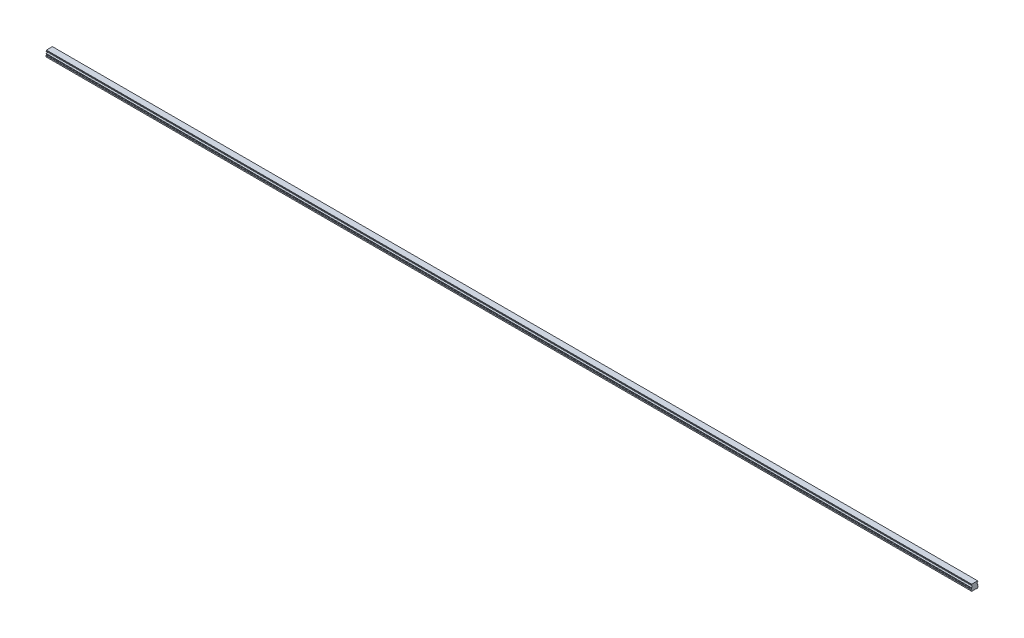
from build123d import *

# Parameters (mm, degrees)
BOSS_EXTRUDE1_DEPTH        = 2040
SKETCH3_R                  = 2.5
SKETCH3_R_2                = 2.1
CUT_EXTRUDE3_DEPTH         = 7
SKETCH3_2_R                = 2.1
CUT_EXTRUDE4_DEPTH         = 9.5
CHAMFER1_SIZE              = 0.4
LPATTERN2_COUNT            = 34
LPATTERN2_PITCH            = 60
CHAMFER1_OF_LPATTERN2_SIZE = 0.4


with BuildPart() as part:
    # Sketch1 → Boss-Extrude1 (new body)
    with BuildSketch(Plane(origin=(0, 0, 0), x_dir=(0, 0, -1), z_dir=(1, 0, 0))):
        with BuildLine():
            Line((6.59, 14), (-6.59, 14))
            Line((-6.59, 14), (-6.59, 13.15))
            Line((-6.59, 13.15), (-6.96, 12.356532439))
            Line((-6.96, 12.356532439), (-6.96, 11.435174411))
            ThreePointArc((-6.96, 11.435174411), (-5.25, 9.5), (-6.96, 7.564825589))
            Line((-6.96, 7.564825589), (-6.96, 6.643467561))
            Line((-6.96, 6.643467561), (-6.59, 5.85))
            Line((-6.59, 5.85), (-7.032116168, 4.2))
            Line((-7.032116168, 4.2), (-7.5, 3.929867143))
            Line((-7.5, 3.929867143), (-7.5, 1.4))
            Line((-7.5, 1.4), (-6.1, 0))
            Line((-6.1, 0), (-3.65, 0))
            Line((-3.65, 0), (-3.25, 0.4))
            Line((-3.25, 0.4), (3.25, 0.4))
            Line((3.25, 0.4), (3.65, 0))
            Line((3.65, 0), (6.1, 0))
            Line((6.1, 0), (7.5, 1.4))
            Line((7.5, 1.4), (7.5, 3.929867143))
            Line((7.5, 3.929867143), (7.032116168, 4.2))
            Line((7.032116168, 4.2), (6.59, 5.85))
            Line((6.59, 5.85), (6.96, 6.643467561))
            Line((6.96, 6.643467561), (6.96, 7.564825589))
            ThreePointArc((6.96, 7.564825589), (5.25, 9.5), (6.96, 11.435174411))
            Line((6.96, 11.435174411), (6.96, 12.356532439))
            Line((6.96, 12.356532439), (6.59, 13.15))
            Line((6.59, 13.15), (6.59, 14))
        make_face()
    extrude(amount=BOSS_EXTRUDE1_DEPTH)

    # Sketch3 → Cut-Extrude3 (cut)
    with BuildSketch(Plane.XZ):
        with Locations(Location((30, 0, 0), (0, 0, 270))):
            Circle(SKETCH3_R)
        with Locations(Location((30, 0, 0), (0, 0, 270))):
            Circle(SKETCH3_R_2, mode=Mode.SUBTRACT)
    cut_extrude3 = extrude(amount=-CUT_EXTRUDE3_DEPTH, mode=Mode.SUBTRACT)

    # Sketch3_2 → Cut-Extrude4 (cut)
    with BuildSketch(Plane.XZ):
        with Locations(Location((30, 0, 0), (0, 0, 270))):
            Circle(SKETCH3_2_R)
    cut_extrude4 = extrude(amount=-CUT_EXTRUDE4_DEPTH, mode=Mode.SUBTRACT)

    # Cut-Extrude5 cone 1 section (on through the dimple's axis) → Cut-Extrude5 (revolve, cut)
    with BuildSketch(Plane(origin=(30, 9.5, 0), x_dir=(0, 0, -1), z_dir=(1, 0, 0))):
        Polygon((0, 0), (2.1, 0), (0, 1.212435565), align=None)
    revolve(axis=Axis((30, 9.5, 0), (0, 1, 0)), mode=Mode.SUBTRACT)

    # Chamfer1
    chamfer1_edges = [part.edges().sort_by_distance(p)[0] for p in [
        (30, 0.4, 2.5),
    ]]
    chamfer(chamfer1_edges, length=CHAMFER1_SIZE)

    # LPattern2: Cut-Extrude3, Cut-Extrude4 ×34
    with Locations(*[(i * LPATTERN2_PITCH, 0, 0) for i in range(1, LPATTERN2_COUNT)]):
        add(cut_extrude3, mode=Mode.SUBTRACT)
        add(cut_extrude4, mode=Mode.SUBTRACT)

    # Chamfer1 of LPattern2
    chamfer1_of_lpattern2_edges = [part.edges().sort_by_distance(p)[0] for p in [
        (90, 0.4, 2.5),
        (150, 0.4, 2.5),
        (210, 0.4, 2.5),
        (270, 0.4, 2.5),
        (330, 0.4, 2.5),
        (390, 0.4, 2.5),
        (450, 0.4, 2.5),
        (510, 0.4, 2.5),
        (570, 0.4, 2.5),
        (630, 0.4, 2.5),
        (690, 0.4, 2.5),
        (750, 0.4, 2.5),
        (810, 0.4, 2.5),
        (870, 0.4, 2.5),
        (930, 0.4, 2.5),
        (990, 0.4, 2.5),
        (1050, 0.4, 2.5),
        (1110, 0.4, 2.5),
        (1170, 0.4, 2.5),
        (1230, 0.4, 2.5),
        (1290, 0.4, 2.5),
        (1350, 0.4, 2.5),
        (1410, 0.4, 2.5),
        (1470, 0.4, 2.5),
        (1530, 0.4, 2.5),
        (1590, 0.4, 2.5),
        (1650, 0.4, 2.5),
        (1710, 0.4, 2.5),
        (1770, 0.4, 2.5),
        (1830, 0.4, 2.5),
        (1890, 0.4, 2.5),
        (1950, 0.4, 2.5),
        (2010, 0.4, 2.5),
    ]]
    chamfer(chamfer1_of_lpattern2_edges, length=CHAMFER1_OF_LPATTERN2_SIZE)


solid = part.part
